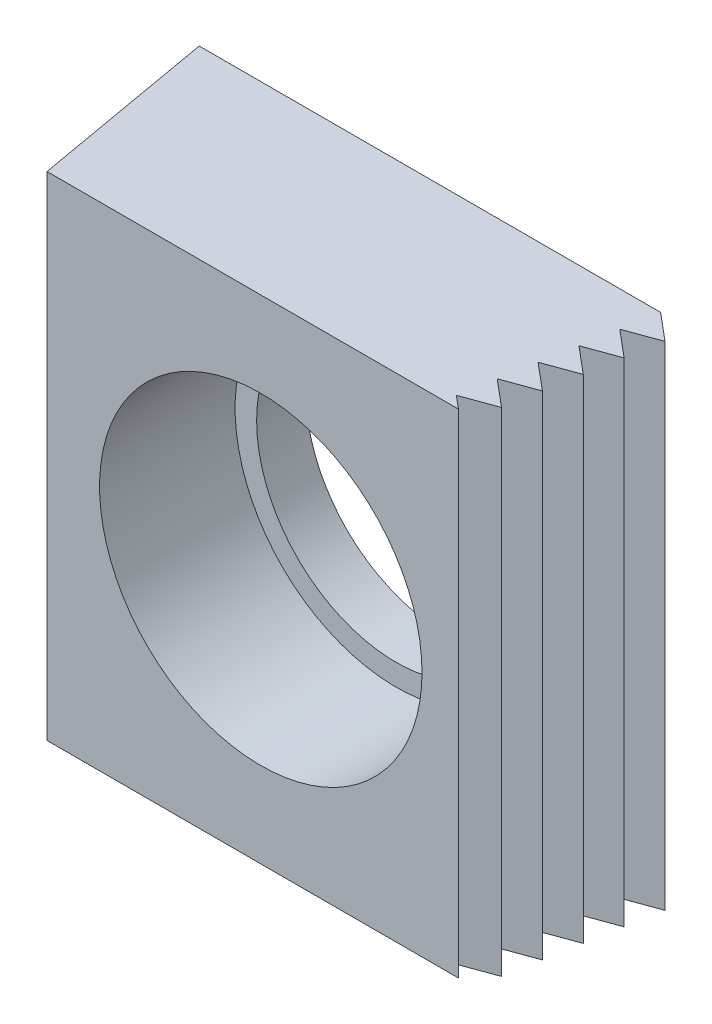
ISO-10303-21;
HEADER;
FILE_DESCRIPTION(('STEP AP214'),'2;1');
FILE_NAME('part.step','',(''),(''),'','','');
FILE_SCHEMA(('AUTOMOTIVE_DESIGN { 1 0 10303 214 1 1 1 1 }'));
ENDSEC;
DATA;
#1=APPLICATION_CONTEXT('core data for automotive mechanical design processes');
#2=APPLICATION_PROTOCOL_DEFINITION('international standard','automotive_design',2000,#1);
#3=PRODUCT_CONTEXT('',#1,'mechanical');
#4=PRODUCT('Part','Part','',(#3));
#5=PRODUCT_RELATED_PRODUCT_CATEGORY('part','',(#4));
#6=PRODUCT_DEFINITION_FORMATION('','',#4);
#7=PRODUCT_DEFINITION_CONTEXT('part definition',#1,'design');
#8=PRODUCT_DEFINITION('design','',#6,#7);
#9=PRODUCT_DEFINITION_SHAPE('','',#8);
#10=(LENGTH_UNIT() NAMED_UNIT(*) SI_UNIT(.MILLI.,.METRE.));
#11=(NAMED_UNIT(*) PLANE_ANGLE_UNIT() SI_UNIT($,.RADIAN.));
#12=(NAMED_UNIT(*) SI_UNIT($,.STERADIAN.) SOLID_ANGLE_UNIT());
#13=UNCERTAINTY_MEASURE_WITH_UNIT(LENGTH_MEASURE(1.E-05),#10,'distance_accuracy_value','');
#14=(GEOMETRIC_REPRESENTATION_CONTEXT(3) GLOBAL_UNCERTAINTY_ASSIGNED_CONTEXT((#13)) GLOBAL_UNIT_ASSIGNED_CONTEXT((#10,
#11,#12)) REPRESENTATION_CONTEXT('',''));
#15=CARTESIAN_POINT('',(0.,0.,0.));
#16=DIRECTION('',(0.,0.,1.));
#17=DIRECTION('',(1.,0.,0.));
#18=AXIS2_PLACEMENT_3D('',#15,#16,#17);
#19=CARTESIAN_POINT('',(0.,8.9789,2.54));
#20=DIRECTION('',(0.,0.,1.));
#21=DIRECTION('',(0.,1.,0.));
#22=AXIS2_PLACEMENT_3D('',#19,#20,#21);
#23=PLANE('',#22);
#24=CARTESIAN_POINT('',(0.,0.,2.54));
#25=DIRECTION('',(0.,0.,1.));
#26=DIRECTION('',(1.,0.,0.));
#27=AXIS2_PLACEMENT_3D('',#24,#25,#26);
#28=CIRCLE('',#27,7.2);
#29=CARTESIAN_POINT('',(7.2,0.,2.54));
#30=VERTEX_POINT('',#29);
#31=EDGE_CURVE('E235',#30,#30,#28,.T.);
#32=ORIENTED_EDGE('',*,*,#31,.F.);
#33=EDGE_LOOP('',(#32));
#34=FACE_BOUND('',#33,.T.);
#35=CARTESIAN_POINT('',(0.,0.,2.54));
#36=DIRECTION('',(0.,0.,1.));
#37=DIRECTION('',(1.,0.,0.));
#38=AXIS2_PLACEMENT_3D('',#35,#36,#37);
#39=CIRCLE('',#38,8.31);
#40=CARTESIAN_POINT('',(8.31,0.,2.54));
#41=VERTEX_POINT('',#40);
#42=EDGE_CURVE('E9',#41,#41,#39,.F.);
#43=ORIENTED_EDGE('',*,*,#42,.F.);
#44=EDGE_LOOP('',(#43));
#45=FACE_BOUND('',#44,.T.);
#46=ADVANCED_FACE('F14',(#34,#45),#23,.T.);
#47=CARTESIAN_POINT('',(12.7,-12.7,9.525));
#48=DIRECTION('',(0.,0.,1.));
#49=DIRECTION('',(0.,1.,0.));
#50=AXIS2_PLACEMENT_3D('',#47,#48,#49);
#51=PLANE('',#50);
#52=DIRECTION('',(1.,0.,0.));
#53=VECTOR('',#52,1.);
#54=CARTESIAN_POINT('',(-12.7,-12.7,9.525));
#55=LINE('',#54,#53);
#56=CARTESIAN_POINT('',(-11.0204855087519,-12.7,9.525));
#57=VERTEX_POINT('',#56);
#58=CARTESIAN_POINT('',(10.1861075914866,-12.7,9.525));
#59=VERTEX_POINT('',#58);
#60=EDGE_CURVE('E224',#57,#59,#55,.T.);
#61=ORIENTED_EDGE('',*,*,#60,.T.);
#62=DIRECTION('',(0.,1.,0.));
#63=VECTOR('',#62,1.);
#64=CARTESIAN_POINT('',(10.1861075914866,-12.7,9.525));
#65=LINE('',#64,#63);
#66=CARTESIAN_POINT('',(10.1861075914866,12.7,9.525));
#67=VERTEX_POINT('',#66);
#68=EDGE_CURVE('E214',#59,#67,#65,.T.);
#69=ORIENTED_EDGE('',*,*,#68,.T.);
#70=DIRECTION('',(-1.,0.,0.));
#71=VECTOR('',#70,1.);
#72=CARTESIAN_POINT('',(-12.7,12.7,9.525));
#73=LINE('',#72,#71);
#74=CARTESIAN_POINT('',(-11.0204855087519,12.7,9.525));
#75=VERTEX_POINT('',#74);
#76=EDGE_CURVE('E22',#67,#75,#73,.T.);
#77=ORIENTED_EDGE('',*,*,#76,.T.);
#78=DIRECTION('',(0.,-1.,0.));
#79=VECTOR('',#78,1.);
#80=CARTESIAN_POINT('',(-11.0204855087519,-12.7,9.525));
#81=LINE('',#80,#79);
#82=EDGE_CURVE('E195',#75,#57,#81,.T.);
#83=ORIENTED_EDGE('',*,*,#82,.T.);
#84=EDGE_LOOP('',(#61,#69,#77,#83));
#85=FACE_BOUND('',#84,.T.);
#86=CARTESIAN_POINT('',(0.,0.,9.525));
#87=DIRECTION('',(0.,0.,1.));
#88=DIRECTION('',(1.,0.,0.));
#89=AXIS2_PLACEMENT_3D('',#86,#87,#88);
#90=CIRCLE('',#89,8.31);
#91=CARTESIAN_POINT('',(8.31,0.,9.525));
#92=VERTEX_POINT('',#91);
#93=EDGE_CURVE('E239',#92,#92,#90,.T.);
#94=ORIENTED_EDGE('',*,*,#93,.F.);
#95=EDGE_LOOP('',(#94));
#96=FACE_BOUND('',#95,.T.);
#97=ADVANCED_FACE('F228',(#85,#96),#51,.T.);
#98=CARTESIAN_POINT('',(12.7,-12.7,0.));
#99=DIRECTION('',(0.,0.,1.));
#100=DIRECTION('',(0.,1.,0.));
#101=AXIS2_PLACEMENT_3D('',#98,#99,#100);
#102=PLANE('',#101);
#103=DIRECTION('',(0.,1.,0.));
#104=VECTOR('',#103,1.);
#105=CARTESIAN_POINT('',(11.0844240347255,-12.7,0.));
#106=LINE('',#105,#104);
#107=CARTESIAN_POINT('',(11.0844240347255,-12.7,0.));
#108=VERTEX_POINT('',#107);
#109=CARTESIAN_POINT('',(11.0844240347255,12.7,0.));
#110=VERTEX_POINT('',#109);
#111=EDGE_CURVE('E193',#108,#110,#106,.T.);
#112=ORIENTED_EDGE('',*,*,#111,.F.);
#113=DIRECTION('',(1.,0.,0.));
#114=VECTOR('',#113,1.);
#115=CARTESIAN_POINT('',(-12.7,-12.7,0.));
#116=LINE('',#115,#114);
#117=CARTESIAN_POINT('',(-12.7,-12.7,0.));
#118=VERTEX_POINT('',#117);
#119=EDGE_CURVE('E217',#118,#108,#116,.T.);
#120=ORIENTED_EDGE('',*,*,#119,.F.);
#121=DIRECTION('',(0.,-1.,0.));
#122=VECTOR('',#121,1.);
#123=CARTESIAN_POINT('',(-12.7,-12.7,0.));
#124=LINE('',#123,#122);
#125=CARTESIAN_POINT('',(-12.7,12.7,0.));
#126=VERTEX_POINT('',#125);
#127=EDGE_CURVE('E222',#126,#118,#124,.T.);
#128=ORIENTED_EDGE('',*,*,#127,.F.);
#129=DIRECTION('',(-1.,0.,0.));
#130=VECTOR('',#129,1.);
#131=CARTESIAN_POINT('',(-12.7,12.7,0.));
#132=LINE('',#131,#130);
#133=EDGE_CURVE('E220',#110,#126,#132,.T.);
#134=ORIENTED_EDGE('',*,*,#133,.F.);
#135=EDGE_LOOP('',(#112,#120,#128,#134));
#136=FACE_BOUND('',#135,.T.);
#137=CARTESIAN_POINT('',(0.,0.,0.));
#138=DIRECTION('',(0.,0.,1.));
#139=DIRECTION('',(1.,0.,0.));
#140=AXIS2_PLACEMENT_3D('',#137,#138,#139);
#141=CIRCLE('',#140,7.2);
#142=CARTESIAN_POINT('',(7.2,0.,0.));
#143=VERTEX_POINT('',#142);
#144=EDGE_CURVE('E233',#143,#143,#141,.T.);
#145=ORIENTED_EDGE('',*,*,#144,.T.);
#146=EDGE_LOOP('',(#145));
#147=FACE_BOUND('',#146,.T.);
#148=ADVANCED_FACE('F247',(#136,#147),#102,.F.);
#149=CARTESIAN_POINT('',(-12.7,-12.7,9.525));
#150=DIRECTION('',(0.,1.,0.));
#151=DIRECTION('',(-1.,0.,0.));
#152=AXIS2_PLACEMENT_3D('',#149,#150,#151);
#153=PLANE('',#152);
#154=DIRECTION('',(-0.766044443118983,0.,-0.642787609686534));
#155=VECTOR('',#154,1.);
#156=CARTESIAN_POINT('',(12.4917742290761,-12.7,1.18090702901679));
#157=LINE('',#156,#155);
#158=CARTESIAN_POINT('',(12.4917742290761,-12.7,1.18090702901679));
#159=VERTEX_POINT('',#158);
#160=EDGE_CURVE('E191',#159,#108,#157,.T.);
#161=ORIENTED_EDGE('',*,*,#160,.F.);
#162=DIRECTION('',(0.939692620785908,0.,-0.34202014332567));
#163=VECTOR('',#162,1.);
#164=CARTESIAN_POINT('',(10.7830161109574,-12.7,1.80284412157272));
#165=LINE('',#164,#163);
#166=CARTESIAN_POINT('',(10.7830161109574,-12.7,1.80284412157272));
#167=VERTEX_POINT('',#166);
#168=EDGE_CURVE('E188',#167,#159,#165,.T.);
#169=ORIENTED_EDGE('',*,*,#168,.F.);
#170=DIRECTION('',(-0.766044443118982,0.,-0.642787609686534));
#171=VECTOR('',#170,1.);
#172=CARTESIAN_POINT('',(12.176008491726,-12.7,2.9717035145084));
#173=LINE('',#172,#171);
#174=CARTESIAN_POINT('',(12.176008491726,-12.7,2.9717035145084));
#175=VERTEX_POINT('',#174);
#176=EDGE_CURVE('E185',#175,#167,#173,.T.);
#177=ORIENTED_EDGE('',*,*,#176,.F.);
#178=DIRECTION('',(0.939692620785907,0.,-0.342020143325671));
#179=VECTOR('',#178,1.);
#180=CARTESIAN_POINT('',(10.4672503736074,-12.7,3.59364060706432));
#181=LINE('',#180,#179);
#182=CARTESIAN_POINT('',(10.4672503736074,-12.7,3.59364060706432));
#183=VERTEX_POINT('',#182);
#184=EDGE_CURVE('E182',#183,#175,#181,.T.);
#185=ORIENTED_EDGE('',*,*,#184,.F.);
#186=DIRECTION('',(-0.766044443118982,0.,-0.642787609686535));
#187=VECTOR('',#186,1.);
#188=CARTESIAN_POINT('',(11.860242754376,-12.7,4.7625));
#189=LINE('',#188,#187);
#190=CARTESIAN_POINT('',(11.860242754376,-12.7,4.7625));
#191=VERTEX_POINT('',#190);
#192=EDGE_CURVE('E179',#191,#183,#189,.T.);
#193=ORIENTED_EDGE('',*,*,#192,.F.);
#194=DIRECTION('',(0.939692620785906,0.,-0.342020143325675));
#195=VECTOR('',#194,1.);
#196=CARTESIAN_POINT('',(11.860242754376,-12.7,4.7625));
#197=LINE('',#196,#195);
#198=CARTESIAN_POINT('',(10.1514846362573,-12.7,5.38443709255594));
#199=VERTEX_POINT('',#198);
#200=EDGE_CURVE('E176',#199,#191,#197,.T.);
#201=ORIENTED_EDGE('',*,*,#200,.F.);
#202=DIRECTION('',(-0.766044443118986,0.,-0.64278760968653));
#203=VECTOR('',#202,1.);
#204=CARTESIAN_POINT('',(10.1514846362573,-12.7,5.38443709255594));
#205=LINE('',#204,#203);
#206=CARTESIAN_POINT('',(11.5444770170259,-12.7,6.5532964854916));
#207=VERTEX_POINT('',#206);
#208=EDGE_CURVE('E173',#207,#199,#205,.T.);
#209=ORIENTED_EDGE('',*,*,#208,.F.);
#210=DIRECTION('',(0.939692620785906,0.,-0.342020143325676));
#211=VECTOR('',#210,1.);
#212=CARTESIAN_POINT('',(11.5444770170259,-12.7,6.5532964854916));
#213=LINE('',#212,#211);
#214=CARTESIAN_POINT('',(9.83571889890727,-12.7,7.17523357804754));
#215=VERTEX_POINT('',#214);
#216=EDGE_CURVE('E170',#215,#207,#213,.T.);
#217=ORIENTED_EDGE('',*,*,#216,.F.);
#218=DIRECTION('',(-0.766044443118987,0.,-0.642787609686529));
#219=VECTOR('',#218,1.);
#220=CARTESIAN_POINT('',(9.83571889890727,-12.7,7.17523357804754));
#221=LINE('',#220,#219);
#222=CARTESIAN_POINT('',(11.2287112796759,-12.7,8.3440929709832));
#223=VERTEX_POINT('',#222);
#224=EDGE_CURVE('E168',#223,#215,#221,.T.);
#225=ORIENTED_EDGE('',*,*,#224,.F.);
#226=DIRECTION('',(0.939692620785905,0.,-0.342020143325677));
#227=VECTOR('',#226,1.);
#228=CARTESIAN_POINT('',(11.2287112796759,-12.7,8.3440929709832));
#229=LINE('',#228,#227);
#230=CARTESIAN_POINT('',(9.51995316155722,-12.7,8.96603006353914));
#231=VERTEX_POINT('',#230);
#232=EDGE_CURVE('E118',#231,#223,#229,.T.);
#233=ORIENTED_EDGE('',*,*,#232,.F.);
#234=DIRECTION('',(-0.766044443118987,0.,-0.642787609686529));
#235=VECTOR('',#234,1.);
#236=CARTESIAN_POINT('',(9.51995316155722,-12.7,8.96603006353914));
#237=LINE('',#236,#235);
#238=EDGE_CURVE('E165',#59,#231,#237,.T.);
#239=ORIENTED_EDGE('',*,*,#238,.F.);
#240=ORIENTED_EDGE('',*,*,#60,.F.);
#241=DIRECTION('',(0.173648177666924,0.,0.984807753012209));
#242=VECTOR('',#241,1.);
#243=CARTESIAN_POINT('',(-12.7,-12.7,0.));
#244=LINE('',#243,#242);
#245=EDGE_CURVE('E163',#118,#57,#244,.T.);
#246=ORIENTED_EDGE('',*,*,#245,.F.);
#247=ORIENTED_EDGE('',*,*,#119,.T.);
#248=EDGE_LOOP('',(#161,#169,#177,#185,#193,#201,#209,#217,#225,#233,#239,#240,#246,#247));
#249=FACE_BOUND('',#248,.T.);
#250=ADVANCED_FACE('F16',(#249),#153,.F.);
#251=CARTESIAN_POINT('',(-12.7,12.7,9.525));
#252=DIRECTION('',(0.,-1.,0.));
#253=DIRECTION('',(1.,0.,0.));
#254=AXIS2_PLACEMENT_3D('',#251,#252,#253);
#255=PLANE('',#254);
#256=DIRECTION('',(-0.766044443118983,0.,-0.642787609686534));
#257=VECTOR('',#256,1.);
#258=CARTESIAN_POINT('',(12.4917742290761,12.7,1.18090702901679));
#259=LINE('',#258,#257);
#260=CARTESIAN_POINT('',(12.4917742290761,12.7,1.18090702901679));
#261=VERTEX_POINT('',#260);
#262=EDGE_CURVE('E161',#261,#110,#259,.T.);
#263=ORIENTED_EDGE('',*,*,#262,.T.);
#264=ORIENTED_EDGE('',*,*,#133,.T.);
#265=DIRECTION('',(0.173648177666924,0.,0.984807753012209));
#266=VECTOR('',#265,1.);
#267=CARTESIAN_POINT('',(-12.7,12.7,0.));
#268=LINE('',#267,#266);
#269=EDGE_CURVE('E37',#126,#75,#268,.T.);
#270=ORIENTED_EDGE('',*,*,#269,.T.);
#271=ORIENTED_EDGE('',*,*,#76,.F.);
#272=DIRECTION('',(-0.766044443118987,0.,-0.642787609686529));
#273=VECTOR('',#272,1.);
#274=CARTESIAN_POINT('',(9.51995316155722,12.7,8.96603006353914));
#275=LINE('',#274,#273);
#276=CARTESIAN_POINT('',(9.51995316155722,12.7,8.96603006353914));
#277=VERTEX_POINT('',#276);
#278=EDGE_CURVE('E137',#67,#277,#275,.T.);
#279=ORIENTED_EDGE('',*,*,#278,.T.);
#280=DIRECTION('',(0.939692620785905,0.,-0.342020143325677));
#281=VECTOR('',#280,1.);
#282=CARTESIAN_POINT('',(11.2287112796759,12.7,8.3440929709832));
#283=LINE('',#282,#281);
#284=CARTESIAN_POINT('',(11.2287112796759,12.7,8.3440929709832));
#285=VERTEX_POINT('',#284);
#286=EDGE_CURVE('E29',#277,#285,#283,.T.);
#287=ORIENTED_EDGE('',*,*,#286,.T.);
#288=DIRECTION('',(-0.766044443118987,0.,-0.642787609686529));
#289=VECTOR('',#288,1.);
#290=CARTESIAN_POINT('',(9.83571889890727,12.7,7.17523357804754));
#291=LINE('',#290,#289);
#292=CARTESIAN_POINT('',(9.83571889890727,12.7,7.17523357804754));
#293=VERTEX_POINT('',#292);
#294=EDGE_CURVE('E126',#285,#293,#291,.T.);
#295=ORIENTED_EDGE('',*,*,#294,.T.);
#296=DIRECTION('',(0.939692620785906,0.,-0.342020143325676));
#297=VECTOR('',#296,1.);
#298=CARTESIAN_POINT('',(11.5444770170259,12.7,6.5532964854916));
#299=LINE('',#298,#297);
#300=CARTESIAN_POINT('',(11.5444770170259,12.7,6.5532964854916));
#301=VERTEX_POINT('',#300);
#302=EDGE_CURVE('E131',#293,#301,#299,.T.);
#303=ORIENTED_EDGE('',*,*,#302,.T.);
#304=DIRECTION('',(-0.766044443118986,0.,-0.64278760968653));
#305=VECTOR('',#304,1.);
#306=CARTESIAN_POINT('',(10.1514846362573,12.7,5.38443709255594));
#307=LINE('',#306,#305);
#308=CARTESIAN_POINT('',(10.1514846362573,12.7,5.38443709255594));
#309=VERTEX_POINT('',#308);
#310=EDGE_CURVE('E143',#301,#309,#307,.T.);
#311=ORIENTED_EDGE('',*,*,#310,.T.);
#312=DIRECTION('',(0.939692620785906,0.,-0.342020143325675));
#313=VECTOR('',#312,1.);
#314=CARTESIAN_POINT('',(11.860242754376,12.7,4.7625));
#315=LINE('',#314,#313);
#316=CARTESIAN_POINT('',(11.860242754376,12.7,4.7625));
#317=VERTEX_POINT('',#316);
#318=EDGE_CURVE('E146',#309,#317,#315,.T.);
#319=ORIENTED_EDGE('',*,*,#318,.T.);
#320=DIRECTION('',(-0.766044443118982,0.,-0.642787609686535));
#321=VECTOR('',#320,1.);
#322=CARTESIAN_POINT('',(11.860242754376,12.7,4.7625));
#323=LINE('',#322,#321);
#324=CARTESIAN_POINT('',(10.4672503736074,12.7,3.59364060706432));
#325=VERTEX_POINT('',#324);
#326=EDGE_CURVE('E149',#317,#325,#323,.T.);
#327=ORIENTED_EDGE('',*,*,#326,.T.);
#328=DIRECTION('',(0.939692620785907,0.,-0.342020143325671));
#329=VECTOR('',#328,1.);
#330=CARTESIAN_POINT('',(10.4672503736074,12.7,3.59364060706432));
#331=LINE('',#330,#329);
#332=CARTESIAN_POINT('',(12.176008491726,12.7,2.9717035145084));
#333=VERTEX_POINT('',#332);
#334=EDGE_CURVE('E152',#325,#333,#331,.T.);
#335=ORIENTED_EDGE('',*,*,#334,.T.);
#336=DIRECTION('',(-0.766044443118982,0.,-0.642787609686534));
#337=VECTOR('',#336,1.);
#338=CARTESIAN_POINT('',(12.176008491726,12.7,2.9717035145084));
#339=LINE('',#338,#337);
#340=CARTESIAN_POINT('',(10.7830161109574,12.7,1.80284412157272));
#341=VERTEX_POINT('',#340);
#342=EDGE_CURVE('E155',#333,#341,#339,.T.);
#343=ORIENTED_EDGE('',*,*,#342,.T.);
#344=DIRECTION('',(0.939692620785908,0.,-0.34202014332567));
#345=VECTOR('',#344,1.);
#346=CARTESIAN_POINT('',(10.7830161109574,12.7,1.80284412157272));
#347=LINE('',#346,#345);
#348=EDGE_CURVE('E158',#341,#261,#347,.T.);
#349=ORIENTED_EDGE('',*,*,#348,.T.);
#350=EDGE_LOOP('',(#263,#264,#270,#271,#279,#287,#295,#303,#311,#319,#327,#335,#343,#349));
#351=FACE_BOUND('',#350,.T.);
#352=ADVANCED_FACE('F135',(#351),#255,.F.);
#353=CARTESIAN_POINT('',(-12.7,-12.7,0.));
#354=DIRECTION('',(-0.984807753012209,0.,0.173648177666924));
#355=DIRECTION('',(0.173648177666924,0.,0.984807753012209));
#356=AXIS2_PLACEMENT_3D('',#353,#354,#355);
#357=PLANE('',#356);
#358=ORIENTED_EDGE('',*,*,#269,.F.);
#359=ORIENTED_EDGE('',*,*,#127,.T.);
#360=ORIENTED_EDGE('',*,*,#245,.T.);
#361=ORIENTED_EDGE('',*,*,#82,.F.);
#362=EDGE_LOOP('',(#358,#359,#360,#361));
#363=FACE_BOUND('',#362,.T.);
#364=ADVANCED_FACE('F260',(#363),#357,.T.);
#365=CARTESIAN_POINT('',(12.4917742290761,-12.7,1.18090702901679));
#366=DIRECTION('',(0.642787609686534,0.,-0.766044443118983));
#367=DIRECTION('',(-0.766044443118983,0.,-0.642787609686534));
#368=AXIS2_PLACEMENT_3D('',#365,#366,#367);
#369=PLANE('',#368);
#370=ORIENTED_EDGE('',*,*,#262,.F.);
#371=DIRECTION('',(0.,1.,0.));
#372=VECTOR('',#371,1.);
#373=CARTESIAN_POINT('',(12.4917742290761,-12.7,1.18090702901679));
#374=LINE('',#373,#372);
#375=EDGE_CURVE('E196',#159,#261,#374,.T.);
#376=ORIENTED_EDGE('',*,*,#375,.F.);
#377=ORIENTED_EDGE('',*,*,#160,.T.);
#378=ORIENTED_EDGE('',*,*,#111,.T.);
#379=EDGE_LOOP('',(#370,#376,#377,#378));
#380=FACE_BOUND('',#379,.T.);
#381=ADVANCED_FACE('F266',(#380),#369,.T.);
#382=CARTESIAN_POINT('',(10.7830161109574,-12.7,1.80284412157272));
#383=DIRECTION('',(0.34202014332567,0.,0.939692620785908));
#384=DIRECTION('',(0.939692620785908,0.,-0.34202014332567));
#385=AXIS2_PLACEMENT_3D('',#382,#383,#384);
#386=PLANE('',#385);
#387=ORIENTED_EDGE('',*,*,#348,.F.);
#388=DIRECTION('',(0.,1.,0.));
#389=VECTOR('',#388,1.);
#390=CARTESIAN_POINT('',(10.7830161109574,-12.7,1.80284412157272));
#391=LINE('',#390,#389);
#392=EDGE_CURVE('E198',#167,#341,#391,.T.);
#393=ORIENTED_EDGE('',*,*,#392,.F.);
#394=ORIENTED_EDGE('',*,*,#168,.T.);
#395=ORIENTED_EDGE('',*,*,#375,.T.);
#396=EDGE_LOOP('',(#387,#393,#394,#395));
#397=FACE_BOUND('',#396,.T.);
#398=ADVANCED_FACE('F321',(#397),#386,.T.);
#399=CARTESIAN_POINT('',(12.176008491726,-12.7,2.9717035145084));
#400=DIRECTION('',(0.642787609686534,0.,-0.766044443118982));
#401=DIRECTION('',(-0.766044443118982,0.,-0.642787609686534));
#402=AXIS2_PLACEMENT_3D('',#399,#400,#401);
#403=PLANE('',#402);
#404=ORIENTED_EDGE('',*,*,#342,.F.);
#405=DIRECTION('',(0.,1.,0.));
#406=VECTOR('',#405,1.);
#407=CARTESIAN_POINT('',(12.176008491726,-12.7,2.9717035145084));
#408=LINE('',#407,#406);
#409=EDGE_CURVE('E200',#175,#333,#408,.T.);
#410=ORIENTED_EDGE('',*,*,#409,.F.);
#411=ORIENTED_EDGE('',*,*,#176,.T.);
#412=ORIENTED_EDGE('',*,*,#392,.T.);
#413=EDGE_LOOP('',(#404,#410,#411,#412));
#414=FACE_BOUND('',#413,.T.);
#415=ADVANCED_FACE('F317',(#414),#403,.T.);
#416=CARTESIAN_POINT('',(10.4672503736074,-12.7,3.59364060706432));
#417=DIRECTION('',(0.342020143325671,0.,0.939692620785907));
#418=DIRECTION('',(0.939692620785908,0.,-0.342020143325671));
#419=AXIS2_PLACEMENT_3D('',#416,#417,#418);
#420=PLANE('',#419);
#421=ORIENTED_EDGE('',*,*,#334,.F.);
#422=DIRECTION('',(0.,1.,0.));
#423=VECTOR('',#422,1.);
#424=CARTESIAN_POINT('',(10.4672503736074,-12.7,3.59364060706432));
#425=LINE('',#424,#423);
#426=EDGE_CURVE('E202',#183,#325,#425,.T.);
#427=ORIENTED_EDGE('',*,*,#426,.F.);
#428=ORIENTED_EDGE('',*,*,#184,.T.);
#429=ORIENTED_EDGE('',*,*,#409,.T.);
#430=EDGE_LOOP('',(#421,#427,#428,#429));
#431=FACE_BOUND('',#430,.T.);
#432=ADVANCED_FACE('F313',(#431),#420,.T.);
#433=CARTESIAN_POINT('',(11.860242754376,-12.7,4.7625));
#434=DIRECTION('',(0.642787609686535,0.,-0.766044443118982));
#435=DIRECTION('',(-0.766044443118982,0.,-0.642787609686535));
#436=AXIS2_PLACEMENT_3D('',#433,#434,#435);
#437=PLANE('',#436);
#438=ORIENTED_EDGE('',*,*,#326,.F.);
#439=DIRECTION('',(0.,1.,0.));
#440=VECTOR('',#439,1.);
#441=CARTESIAN_POINT('',(11.860242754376,-12.7,4.7625));
#442=LINE('',#441,#440);
#443=EDGE_CURVE('E204',#191,#317,#442,.T.);
#444=ORIENTED_EDGE('',*,*,#443,.F.);
#445=ORIENTED_EDGE('',*,*,#192,.T.);
#446=ORIENTED_EDGE('',*,*,#426,.T.);
#447=EDGE_LOOP('',(#438,#444,#445,#446));
#448=FACE_BOUND('',#447,.T.);
#449=ADVANCED_FACE('F309',(#448),#437,.T.);
#450=CARTESIAN_POINT('',(11.860242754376,-12.7,4.7625));
#451=DIRECTION('',(0.342020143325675,0.,0.939692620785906));
#452=DIRECTION('',(0.939692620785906,0.,-0.342020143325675));
#453=AXIS2_PLACEMENT_3D('',#450,#451,#452);
#454=PLANE('',#453);
#455=ORIENTED_EDGE('',*,*,#318,.F.);
#456=DIRECTION('',(0.,1.,0.));
#457=VECTOR('',#456,1.);
#458=CARTESIAN_POINT('',(10.1514846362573,-12.7,5.38443709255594));
#459=LINE('',#458,#457);
#460=EDGE_CURVE('E206',#199,#309,#459,.T.);
#461=ORIENTED_EDGE('',*,*,#460,.F.);
#462=ORIENTED_EDGE('',*,*,#200,.T.);
#463=ORIENTED_EDGE('',*,*,#443,.T.);
#464=EDGE_LOOP('',(#455,#461,#462,#463));
#465=FACE_BOUND('',#464,.T.);
#466=ADVANCED_FACE('F305',(#465),#454,.T.);
#467=CARTESIAN_POINT('',(10.1514846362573,-12.7,5.38443709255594));
#468=DIRECTION('',(0.64278760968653,0.,-0.766044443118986));
#469=DIRECTION('',(-0.766044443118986,0.,-0.64278760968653));
#470=AXIS2_PLACEMENT_3D('',#467,#468,#469);
#471=PLANE('',#470);
#472=ORIENTED_EDGE('',*,*,#310,.F.);
#473=DIRECTION('',(0.,1.,0.));
#474=VECTOR('',#473,1.);
#475=CARTESIAN_POINT('',(11.5444770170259,-12.7,6.5532964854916));
#476=LINE('',#475,#474);
#477=EDGE_CURVE('E208',#207,#301,#476,.T.);
#478=ORIENTED_EDGE('',*,*,#477,.F.);
#479=ORIENTED_EDGE('',*,*,#208,.T.);
#480=ORIENTED_EDGE('',*,*,#460,.T.);
#481=EDGE_LOOP('',(#472,#478,#479,#480));
#482=FACE_BOUND('',#481,.T.);
#483=ADVANCED_FACE('F301',(#482),#471,.T.);
#484=CARTESIAN_POINT('',(11.5444770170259,-12.7,6.5532964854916));
#485=DIRECTION('',(0.342020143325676,0.,0.939692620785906));
#486=DIRECTION('',(0.939692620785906,0.,-0.342020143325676));
#487=AXIS2_PLACEMENT_3D('',#484,#485,#486);
#488=PLANE('',#487);
#489=ORIENTED_EDGE('',*,*,#302,.F.);
#490=DIRECTION('',(0.,1.,0.));
#491=VECTOR('',#490,1.);
#492=CARTESIAN_POINT('',(9.83571889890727,-12.7,7.17523357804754));
#493=LINE('',#492,#491);
#494=EDGE_CURVE('E122',#215,#293,#493,.T.);
#495=ORIENTED_EDGE('',*,*,#494,.F.);
#496=ORIENTED_EDGE('',*,*,#216,.T.);
#497=ORIENTED_EDGE('',*,*,#477,.T.);
#498=EDGE_LOOP('',(#489,#495,#496,#497));
#499=FACE_BOUND('',#498,.T.);
#500=ADVANCED_FACE('F298',(#499),#488,.T.);
#501=CARTESIAN_POINT('',(9.83571889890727,-12.7,7.17523357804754));
#502=DIRECTION('',(0.642787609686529,0.,-0.766044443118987));
#503=DIRECTION('',(-0.766044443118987,0.,-0.642787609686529));
#504=AXIS2_PLACEMENT_3D('',#501,#502,#503);
#505=PLANE('',#504);
#506=ORIENTED_EDGE('',*,*,#294,.F.);
#507=DIRECTION('',(0.,1.,0.));
#508=VECTOR('',#507,1.);
#509=CARTESIAN_POINT('',(11.2287112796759,-12.7,8.3440929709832));
#510=LINE('',#509,#508);
#511=EDGE_CURVE('E114',#223,#285,#510,.T.);
#512=ORIENTED_EDGE('',*,*,#511,.F.);
#513=ORIENTED_EDGE('',*,*,#224,.T.);
#514=ORIENTED_EDGE('',*,*,#494,.T.);
#515=EDGE_LOOP('',(#506,#512,#513,#514));
#516=FACE_BOUND('',#515,.T.);
#517=ADVANCED_FACE('F127',(#516),#505,.T.);
#518=CARTESIAN_POINT('',(11.2287112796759,-12.7,8.3440929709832));
#519=DIRECTION('',(0.342020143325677,0.,0.939692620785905));
#520=DIRECTION('',(0.939692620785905,0.,-0.342020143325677));
#521=AXIS2_PLACEMENT_3D('',#518,#519,#520);
#522=PLANE('',#521);
#523=ORIENTED_EDGE('',*,*,#286,.F.);
#524=DIRECTION('',(0.,1.,0.));
#525=VECTOR('',#524,1.);
#526=CARTESIAN_POINT('',(9.51995316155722,-12.7,8.96603006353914));
#527=LINE('',#526,#525);
#528=EDGE_CURVE('E123',#231,#277,#527,.T.);
#529=ORIENTED_EDGE('',*,*,#528,.F.);
#530=ORIENTED_EDGE('',*,*,#232,.T.);
#531=ORIENTED_EDGE('',*,*,#511,.T.);
#532=EDGE_LOOP('',(#523,#529,#530,#531));
#533=FACE_BOUND('',#532,.T.);
#534=ADVANCED_FACE('F116',(#533),#522,.T.);
#535=CARTESIAN_POINT('',(9.51995316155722,-12.7,8.96603006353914));
#536=DIRECTION('',(0.642787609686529,0.,-0.766044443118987));
#537=DIRECTION('',(-0.766044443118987,0.,-0.642787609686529));
#538=AXIS2_PLACEMENT_3D('',#535,#536,#537);
#539=PLANE('',#538);
#540=ORIENTED_EDGE('',*,*,#238,.T.);
#541=ORIENTED_EDGE('',*,*,#528,.T.);
#542=ORIENTED_EDGE('',*,*,#278,.F.);
#543=ORIENTED_EDGE('',*,*,#68,.F.);
#544=EDGE_LOOP('',(#540,#541,#542,#543));
#545=FACE_BOUND('',#544,.T.);
#546=ADVANCED_FACE('F283',(#545),#539,.T.);
#547=CARTESIAN_POINT('',(0.,0.,0.));
#548=DIRECTION('',(0.,0.,1.));
#549=DIRECTION('',(1.,0.,0.));
#550=AXIS2_PLACEMENT_3D('',#547,#548,#549);
#551=CYLINDRICAL_SURFACE('',#550,7.2);
#552=ORIENTED_EDGE('',*,*,#144,.F.);
#553=EDGE_LOOP('',(#552));
#554=FACE_BOUND('',#553,.T.);
#555=ORIENTED_EDGE('',*,*,#31,.T.);
#556=EDGE_LOOP('',(#555));
#557=FACE_BOUND('',#556,.T.);
#558=ADVANCED_FACE('F285',(#554,#557),#551,.F.);
#559=CARTESIAN_POINT('',(0.,0.,9.525));
#560=DIRECTION('',(0.,0.,-1.));
#561=DIRECTION('',(-1.,0.,0.));
#562=AXIS2_PLACEMENT_3D('',#559,#560,#561);
#563=CYLINDRICAL_SURFACE('',#562,8.31);
#564=ORIENTED_EDGE('',*,*,#93,.T.);
#565=EDGE_LOOP('',(#564));
#566=FACE_BOUND('',#565,.T.);
#567=ORIENTED_EDGE('',*,*,#42,.T.);
#568=EDGE_LOOP('',(#567));
#569=FACE_BOUND('',#568,.T.);
#570=ADVANCED_FACE('F244',(#566,#569),#563,.F.);
#571=CLOSED_SHELL('',(#46,#97,#148,#250,#352,#364,#381,#398,#415,#432,#449,#466,#483,#500,#517,
#534,#546,#558,#570));
#572=MANIFOLD_SOLID_BREP('B1',#571);
#573=ADVANCED_BREP_SHAPE_REPRESENTATION('',(#18,#572),#14);
#574=SHAPE_DEFINITION_REPRESENTATION(#9,#573);
ENDSEC;
END-ISO-10303-21;
